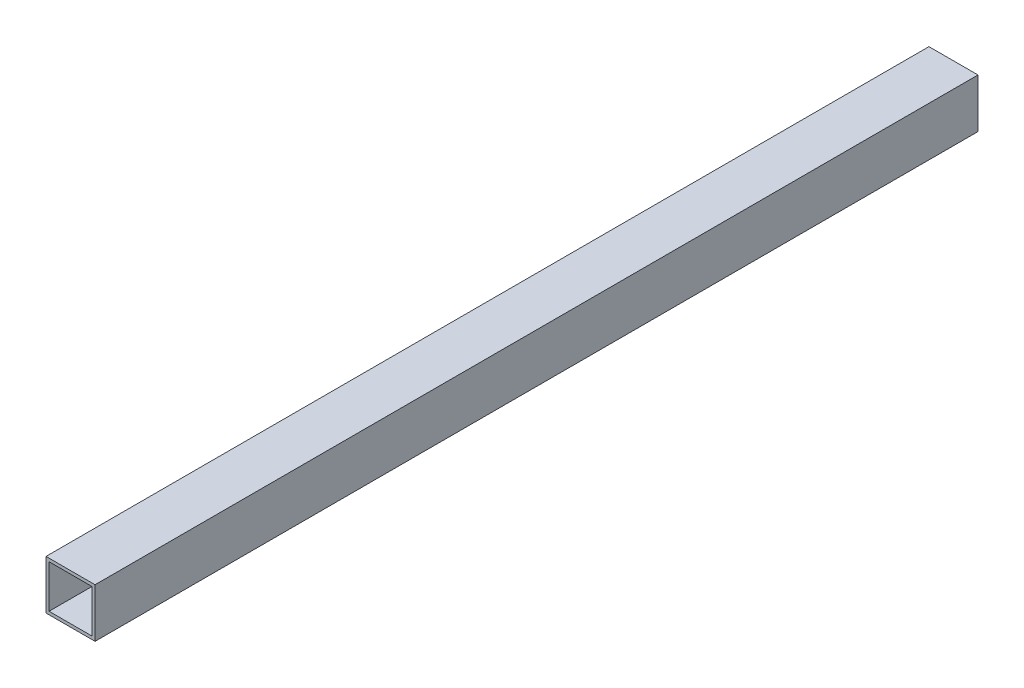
from build123d import *

# Parameters (mm, degrees)
SKETCH1_W          = 25.4
SKETCH1_H          = 25.4
SKETCH1_W_2        = 22.225
SKETCH1_H_2        = 22.225
BASE_EXTRUDE_DEPTH = 457.2


with BuildPart() as part:
    # Sketch1 → Base-Extrude (new body)
    with BuildSketch(Plane.XY):
        with Locations((12.7, 12.7)):
            Rectangle(SKETCH1_W, SKETCH1_H)
        with Locations((12.7, 12.7)):
            Rectangle(SKETCH1_W_2, SKETCH1_H_2, mode=Mode.SUBTRACT)
    extrude(amount=BASE_EXTRUDE_DEPTH)


solid = part.part
